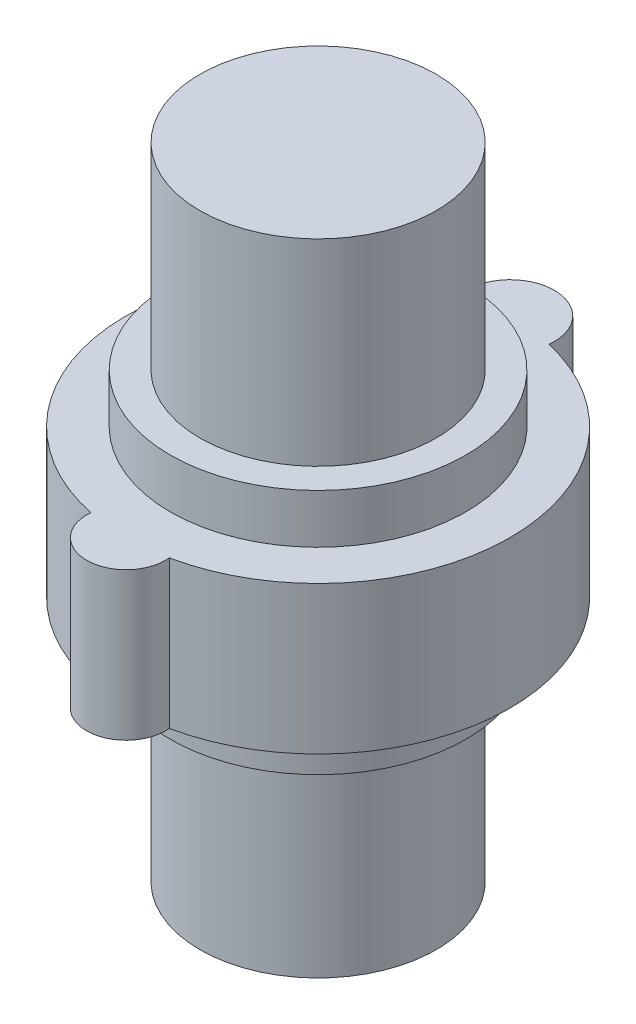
from build123d import *

# Parameters (mm, degrees)
RESSALTO_EXTRUS_O1_DEPTH = 3
ESBO_O2_R                = 3
RESSALTO_EXTRUS_O2_DEPTH = 1
ESBO_O3_R                = 2.4
RESSALTO_EXTRUS_O3_DEPTH = 4
RESSALTO_EXTRUS_O4_START = 1
ESBO_O4_R                = 3
RESSALTO_EXTRUS_O4_DEPTH = 1
RESSALTO_EXTRUS_O5_START = 4
ESBO_O5_R                = 2.4
RESSALTO_EXTRUS_O5_DEPTH = 4


with BuildPart() as part:
    # Esbo_o1 → Ressalto-extrus_o1 (new body)
    with BuildSketch(Plane(origin=(0, 0, 0), x_dir=(1, 0, 0), z_dir=(0, 1, 0))):
        with BuildLine():
            ThreePointArc((-0.893988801, 3.796153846), (-3.899675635, -0.050298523), (-0.795781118, -3.817948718))
            ThreePointArc((-0.795781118, -3.817948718), (0, -4.7), (0.795781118, -3.817948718))
            ThreePointArc((0.795781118, -3.817948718), (3.899675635, -0.050298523), (0.893988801, 3.796153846))
            ThreePointArc((0.893988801, 3.796153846), (0, 4.8), (-0.893988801, 3.796153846))
        make_face()
    extrude(amount=RESSALTO_EXTRUS_O1_DEPTH)

    # Esbo_o2 → Ressalto-extrus_o2 (add)
    with BuildSketch(Plane(origin=(0, 3, 0), x_dir=(1, 0, 0), z_dir=(0, 1, 0))):
        with Locations(Location((0, 0, 0), (0, 0, 270))):
            Circle(ESBO_O2_R)
    extrude(amount=RESSALTO_EXTRUS_O2_DEPTH)

    # Esbo_o3 → Ressalto-extrus_o3 (add)
    with BuildSketch(Plane(origin=(0, 4, 0), x_dir=(1, 0, 0), z_dir=(0, 1, 0))):
        with Locations(Location((0, 0, 0), (0, 0, 270))):
            Circle(ESBO_O3_R)
    extrude(amount=RESSALTO_EXTRUS_O3_DEPTH)

    # Esbo_o4 → Ressalto-extrus_o4 (add)
    with BuildSketch(Plane(origin=(0, 0, 0), x_dir=(-1, 0, 0), z_dir=(0, -1, 0)).offset(RESSALTO_EXTRUS_O4_START)):
        with Locations(Location((0, 0, 0), (0, 0, 270))):
            Circle(ESBO_O4_R)
    extrude(amount=-RESSALTO_EXTRUS_O4_DEPTH)

    # Esbo_o5 → Ressalto-extrus_o5 (add)
    with BuildSketch(Plane.XZ.offset(1).offset(RESSALTO_EXTRUS_O5_START)):
        with Locations(Location((0, 0, 0), (0, 0, 90))):
            Circle(ESBO_O5_R)
    extrude(amount=-RESSALTO_EXTRUS_O5_DEPTH)


solid = part.part
